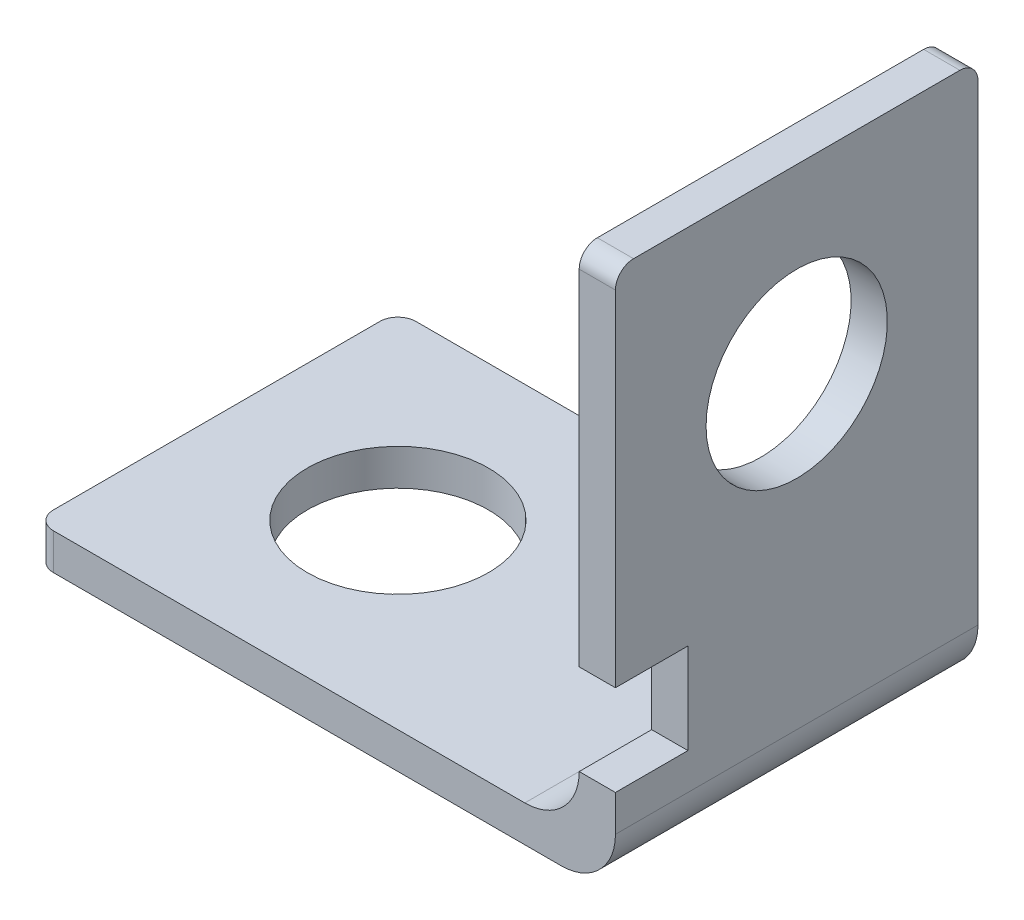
ISO-10303-21;
HEADER;
FILE_DESCRIPTION(('STEP AP214'),'2;1');
FILE_NAME('part.step','',(''),(''),'','','');
FILE_SCHEMA(('AUTOMOTIVE_DESIGN { 1 0 10303 214 1 1 1 1 }'));
ENDSEC;
DATA;
#1=APPLICATION_CONTEXT('core data for automotive mechanical design processes');
#2=APPLICATION_PROTOCOL_DEFINITION('international standard','automotive_design',2000,#1);
#3=PRODUCT_CONTEXT('',#1,'mechanical');
#4=PRODUCT('Part','Part','',(#3));
#5=PRODUCT_RELATED_PRODUCT_CATEGORY('part','',(#4));
#6=PRODUCT_DEFINITION_FORMATION('','',#4);
#7=PRODUCT_DEFINITION_CONTEXT('part definition',#1,'design');
#8=PRODUCT_DEFINITION('design','',#6,#7);
#9=PRODUCT_DEFINITION_SHAPE('','',#8);
#10=(LENGTH_UNIT() NAMED_UNIT(*) SI_UNIT(.MILLI.,.METRE.));
#11=(NAMED_UNIT(*) PLANE_ANGLE_UNIT() SI_UNIT($,.RADIAN.));
#12=(NAMED_UNIT(*) SI_UNIT($,.STERADIAN.) SOLID_ANGLE_UNIT());
#13=UNCERTAINTY_MEASURE_WITH_UNIT(LENGTH_MEASURE(1.E-05),#10,'distance_accuracy_value','');
#14=(GEOMETRIC_REPRESENTATION_CONTEXT(3) GLOBAL_UNCERTAINTY_ASSIGNED_CONTEXT((#13)) GLOBAL_UNIT_ASSIGNED_CONTEXT((#10,
#11,#12)) REPRESENTATION_CONTEXT('',''));
#15=CARTESIAN_POINT('',(0.,0.,0.));
#16=DIRECTION('',(0.,0.,1.));
#17=DIRECTION('',(1.,0.,0.));
#18=AXIS2_PLACEMENT_3D('',#15,#16,#17);
#19=CARTESIAN_POINT('',(0.,2.,20.));
#20=DIRECTION('',(0.,0.,-1.));
#21=DIRECTION('',(-1.,0.,0.));
#22=AXIS2_PLACEMENT_3D('',#19,#20,#21);
#23=PLANE('',#22);
#24=DIRECTION('',(0.,-1.,0.));
#25=VECTOR('',#24,1.);
#26=CARTESIAN_POINT('',(32.,2.,20.));
#27=LINE('',#26,#25);
#28=CARTESIAN_POINT('',(32.,5.,20.));
#29=VERTEX_POINT('',#28);
#30=CARTESIAN_POINT('',(32.,3.,20.));
#31=VERTEX_POINT('',#30);
#32=EDGE_CURVE('E245',#29,#31,#27,.T.);
#33=ORIENTED_EDGE('',*,*,#32,.F.);
#34=DIRECTION('',(-1.,0.,0.));
#35=VECTOR('',#34,1.);
#36=CARTESIAN_POINT('',(60.,5.,20.));
#37=LINE('',#36,#35);
#38=CARTESIAN_POINT('',(30.,5.,20.));
#39=VERTEX_POINT('',#38);
#40=EDGE_CURVE('E186',#29,#39,#37,.T.);
#41=ORIENTED_EDGE('',*,*,#40,.T.);
#42=CARTESIAN_POINT('',(27.,5.,20.));
#43=DIRECTION('',(0.,0.,-1.));
#44=DIRECTION('',(-1.,0.,0.));
#45=AXIS2_PLACEMENT_3D('',#42,#43,#44);
#46=CIRCLE('',#45,3.);
#47=CARTESIAN_POINT('',(27.,2.,20.));
#48=VERTEX_POINT('',#47);
#49=EDGE_CURVE('E300',#39,#48,#46,.T.);
#50=ORIENTED_EDGE('',*,*,#49,.T.);
#51=DIRECTION('',(1.,0.,0.));
#52=VECTOR('',#51,1.);
#53=CARTESIAN_POINT('',(0.,2.,20.));
#54=LINE('',#53,#52);
#55=CARTESIAN_POINT('',(1.,2.,20.));
#56=VERTEX_POINT('',#55);
#57=EDGE_CURVE('E224',#56,#48,#54,.T.);
#58=ORIENTED_EDGE('',*,*,#57,.F.);
#59=DIRECTION('',(0.,-1.,0.));
#60=VECTOR('',#59,1.);
#61=CARTESIAN_POINT('',(1.,2.,20.));
#62=LINE('',#61,#60);
#63=CARTESIAN_POINT('',(1.,0.,20.));
#64=VERTEX_POINT('',#63);
#65=EDGE_CURVE('E249',#56,#64,#62,.T.);
#66=ORIENTED_EDGE('',*,*,#65,.T.);
#67=DIRECTION('',(1.,0.,0.));
#68=VECTOR('',#67,1.);
#69=CARTESIAN_POINT('',(0.,0.,20.));
#70=LINE('',#69,#68);
#71=CARTESIAN_POINT('',(29.,0.,20.));
#72=VERTEX_POINT('',#71);
#73=EDGE_CURVE('E237',#64,#72,#70,.T.);
#74=ORIENTED_EDGE('',*,*,#73,.T.);
#75=CARTESIAN_POINT('',(29.,3.,20.));
#76=DIRECTION('',(0.,0.,-1.));
#77=DIRECTION('',(-1.,0.,0.));
#78=AXIS2_PLACEMENT_3D('',#75,#76,#77);
#79=CIRCLE('',#78,3.);
#80=EDGE_CURVE('E290',#72,#31,#79,.F.);
#81=ORIENTED_EDGE('',*,*,#80,.T.);
#82=EDGE_LOOP('',(#33,#41,#50,#58,#66,#74,#81));
#83=FACE_BOUND('',#82,.T.);
#84=ADVANCED_FACE('F38',(#83),#23,.F.);
#85=CARTESIAN_POINT('',(0.,2.,0.));
#86=DIRECTION('',(1.,0.,0.));
#87=DIRECTION('',(0.,0.,-1.));
#88=AXIS2_PLACEMENT_3D('',#85,#86,#87);
#89=PLANE('',#88);
#90=DIRECTION('',(0.,0.,1.));
#91=VECTOR('',#90,1.);
#92=CARTESIAN_POINT('',(0.,0.,0.));
#93=LINE('',#92,#91);
#94=CARTESIAN_POINT('',(0.,0.,1.));
#95=VERTEX_POINT('',#94);
#96=CARTESIAN_POINT('',(0.,0.,19.));
#97=VERTEX_POINT('',#96);
#98=EDGE_CURVE('E233',#95,#97,#93,.T.);
#99=ORIENTED_EDGE('',*,*,#98,.T.);
#100=DIRECTION('',(0.,-1.,0.));
#101=VECTOR('',#100,1.);
#102=CARTESIAN_POINT('',(0.,2.,19.));
#103=LINE('',#102,#101);
#104=CARTESIAN_POINT('',(0.,2.,19.));
#105=VERTEX_POINT('',#104);
#106=EDGE_CURVE('E267',#97,#105,#103,.F.);
#107=ORIENTED_EDGE('',*,*,#106,.T.);
#108=DIRECTION('',(0.,0.,1.));
#109=VECTOR('',#108,1.);
#110=CARTESIAN_POINT('',(0.,2.,0.));
#111=LINE('',#110,#109);
#112=CARTESIAN_POINT('',(0.,2.,1.));
#113=VERTEX_POINT('',#112);
#114=EDGE_CURVE('E220',#113,#105,#111,.T.);
#115=ORIENTED_EDGE('',*,*,#114,.F.);
#116=DIRECTION('',(0.,-1.,0.));
#117=VECTOR('',#116,1.);
#118=CARTESIAN_POINT('',(0.,2.,1.));
#119=LINE('',#118,#117);
#120=EDGE_CURVE('E263',#113,#95,#119,.T.);
#121=ORIENTED_EDGE('',*,*,#120,.T.);
#122=EDGE_LOOP('',(#99,#107,#115,#121));
#123=FACE_BOUND('',#122,.T.);
#124=ADVANCED_FACE('F376',(#123),#89,.F.);
#125=CARTESIAN_POINT('',(32.,29.,20.));
#126=VERTEX_POINT('',#125);
#127=CARTESIAN_POINT('',(32.,10.,20.));
#128=VERTEX_POINT('',#127);
#129=EDGE_CURVE('E246',#126,#128,#27,.T.);
#130=ORIENTED_EDGE('',*,*,#129,.F.);
#131=DIRECTION('',(1.,0.,0.));
#132=VECTOR('',#131,1.);
#133=CARTESIAN_POINT('',(0.,29.,20.));
#134=LINE('',#133,#132);
#135=CARTESIAN_POINT('',(30.,29.,20.));
#136=VERTEX_POINT('',#135);
#137=EDGE_CURVE('E62',#126,#136,#134,.F.);
#138=ORIENTED_EDGE('',*,*,#137,.T.);
#139=DIRECTION('',(0.,-1.,0.));
#140=VECTOR('',#139,1.);
#141=CARTESIAN_POINT('',(30.,30.,20.));
#142=LINE('',#141,#140);
#143=CARTESIAN_POINT('',(30.,10.,20.));
#144=VERTEX_POINT('',#143);
#145=EDGE_CURVE('E147',#136,#144,#142,.T.);
#146=ORIENTED_EDGE('',*,*,#145,.T.);
#147=DIRECTION('',(-1.,0.,0.));
#148=VECTOR('',#147,1.);
#149=CARTESIAN_POINT('',(60.,10.,20.));
#150=LINE('',#149,#148);
#151=EDGE_CURVE('E150',#128,#144,#150,.T.);
#152=ORIENTED_EDGE('',*,*,#151,.F.);
#153=EDGE_LOOP('',(#130,#138,#146,#152));
#154=FACE_BOUND('',#153,.T.);
#155=ADVANCED_FACE('F149',(#154),#23,.F.);
#156=CARTESIAN_POINT('',(32.,2.,0.));
#157=DIRECTION('',(-1.,0.,0.));
#158=DIRECTION('',(0.,0.,1.));
#159=AXIS2_PLACEMENT_3D('',#156,#157,#158);
#160=PLANE('',#159);
#161=CARTESIAN_POINT('',(32.,20.,10.));
#162=DIRECTION('',(-1.,0.,0.));
#163=DIRECTION('',(0.,0.,1.));
#164=AXIS2_PLACEMENT_3D('',#161,#162,#163);
#165=CIRCLE('',#164,5.);
#166=CARTESIAN_POINT('',(32.,20.,15.));
#167=VERTEX_POINT('',#166);
#168=EDGE_CURVE('E174',#167,#167,#165,.T.);
#169=ORIENTED_EDGE('',*,*,#168,.T.);
#170=EDGE_LOOP('',(#169));
#171=FACE_BOUND('',#170,.T.);
#172=DIRECTION('',(0.,0.,-1.));
#173=VECTOR('',#172,1.);
#174=CARTESIAN_POINT('',(32.,30.,0.));
#175=LINE('',#174,#173);
#176=CARTESIAN_POINT('',(32.,30.,19.));
#177=VERTEX_POINT('',#176);
#178=CARTESIAN_POINT('',(32.,30.,1.));
#179=VERTEX_POINT('',#178);
#180=EDGE_CURVE('E206',#177,#179,#175,.T.);
#181=ORIENTED_EDGE('',*,*,#180,.F.);
#182=CARTESIAN_POINT('',(32.,29.,19.));
#183=DIRECTION('',(-1.,0.,0.));
#184=DIRECTION('',(0.,0.,1.));
#185=AXIS2_PLACEMENT_3D('',#182,#183,#184);
#186=CIRCLE('',#185,1.);
#187=EDGE_CURVE('E318',#177,#126,#186,.F.);
#188=ORIENTED_EDGE('',*,*,#187,.T.);
#189=ORIENTED_EDGE('',*,*,#129,.T.);
#190=DIRECTION('',(0.,0.,-1.));
#191=VECTOR('',#190,1.);
#192=CARTESIAN_POINT('',(32.,10.,0.));
#193=LINE('',#192,#191);
#194=CARTESIAN_POINT('',(32.,10.,16.));
#195=VERTEX_POINT('',#194);
#196=EDGE_CURVE('E165',#128,#195,#193,.T.);
#197=ORIENTED_EDGE('',*,*,#196,.T.);
#198=DIRECTION('',(0.,-1.,0.));
#199=VECTOR('',#198,1.);
#200=CARTESIAN_POINT('',(32.,2.,16.));
#201=LINE('',#200,#199);
#202=CARTESIAN_POINT('',(32.,5.,16.));
#203=VERTEX_POINT('',#202);
#204=EDGE_CURVE('E202',#195,#203,#201,.T.);
#205=ORIENTED_EDGE('',*,*,#204,.T.);
#206=DIRECTION('',(0.,0.,1.));
#207=VECTOR('',#206,1.);
#208=CARTESIAN_POINT('',(32.,5.,0.));
#209=LINE('',#208,#207);
#210=EDGE_CURVE('E190',#203,#29,#209,.T.);
#211=ORIENTED_EDGE('',*,*,#210,.T.);
#212=ORIENTED_EDGE('',*,*,#32,.T.);
#213=DIRECTION('',(0.,0.,-1.));
#214=VECTOR('',#213,1.);
#215=CARTESIAN_POINT('',(32.,3.,0.));
#216=LINE('',#215,#214);
#217=CARTESIAN_POINT('',(32.,3.,0.));
#218=VERTEX_POINT('',#217);
#219=EDGE_CURVE('E280',#31,#218,#216,.T.);
#220=ORIENTED_EDGE('',*,*,#219,.T.);
#221=DIRECTION('',(0.,-1.,0.));
#222=VECTOR('',#221,1.);
#223=CARTESIAN_POINT('',(32.,2.,0.));
#224=LINE('',#223,#222);
#225=CARTESIAN_POINT('',(32.,29.,0.));
#226=VERTEX_POINT('',#225);
#227=EDGE_CURVE('E232',#226,#218,#224,.T.);
#228=ORIENTED_EDGE('',*,*,#227,.F.);
#229=CARTESIAN_POINT('',(32.,29.,1.));
#230=DIRECTION('',(-1.,0.,0.));
#231=DIRECTION('',(0.,0.,1.));
#232=AXIS2_PLACEMENT_3D('',#229,#230,#231);
#233=CIRCLE('',#232,1.);
#234=EDGE_CURVE('E315',#226,#179,#233,.F.);
#235=ORIENTED_EDGE('',*,*,#234,.T.);
#236=EDGE_LOOP('',(#181,#188,#189,#197,#205,#211,#212,#220,#228,#235));
#237=FACE_BOUND('',#236,.T.);
#238=ADVANCED_FACE('F333',(#171,#237),#160,.F.);
#239=CARTESIAN_POINT('',(0.,2.,0.));
#240=DIRECTION('',(0.,0.,1.));
#241=DIRECTION('',(1.,0.,0.));
#242=AXIS2_PLACEMENT_3D('',#239,#240,#241);
#243=PLANE('',#242);
#244=DIRECTION('',(0.,-1.,0.));
#245=VECTOR('',#244,1.);
#246=CARTESIAN_POINT('',(30.,30.,0.));
#247=LINE('',#246,#245);
#248=CARTESIAN_POINT('',(30.,29.,0.));
#249=VERTEX_POINT('',#248);
#250=CARTESIAN_POINT('',(30.,5.,0.));
#251=VERTEX_POINT('',#250);
#252=EDGE_CURVE('E154',#249,#251,#247,.T.);
#253=ORIENTED_EDGE('',*,*,#252,.F.);
#254=DIRECTION('',(-1.,0.,0.));
#255=VECTOR('',#254,1.);
#256=CARTESIAN_POINT('',(0.,29.,0.));
#257=LINE('',#256,#255);
#258=EDGE_CURVE('E11',#249,#226,#257,.F.);
#259=ORIENTED_EDGE('',*,*,#258,.T.);
#260=ORIENTED_EDGE('',*,*,#227,.T.);
#261=CARTESIAN_POINT('',(29.,3.,0.));
#262=DIRECTION('',(0.,0.,1.));
#263=DIRECTION('',(1.,0.,0.));
#264=AXIS2_PLACEMENT_3D('',#261,#262,#263);
#265=CIRCLE('',#264,3.);
#266=CARTESIAN_POINT('',(29.,0.,0.));
#267=VERTEX_POINT('',#266);
#268=EDGE_CURVE('E284',#218,#267,#265,.F.);
#269=ORIENTED_EDGE('',*,*,#268,.T.);
#270=DIRECTION('',(-1.,0.,0.));
#271=VECTOR('',#270,1.);
#272=CARTESIAN_POINT('',(0.,0.,0.));
#273=LINE('',#272,#271);
#274=CARTESIAN_POINT('',(1.,0.,0.));
#275=VERTEX_POINT('',#274);
#276=EDGE_CURVE('E225',#267,#275,#273,.T.);
#277=ORIENTED_EDGE('',*,*,#276,.T.);
#278=DIRECTION('',(0.,-1.,0.));
#279=VECTOR('',#278,1.);
#280=CARTESIAN_POINT('',(1.,2.,0.));
#281=LINE('',#280,#279);
#282=CARTESIAN_POINT('',(1.,2.,0.));
#283=VERTEX_POINT('',#282);
#284=EDGE_CURVE('E276',#275,#283,#281,.F.);
#285=ORIENTED_EDGE('',*,*,#284,.T.);
#286=DIRECTION('',(-1.,0.,0.));
#287=VECTOR('',#286,1.);
#288=CARTESIAN_POINT('',(0.,2.,0.));
#289=LINE('',#288,#287);
#290=CARTESIAN_POINT('',(27.,2.,0.));
#291=VERTEX_POINT('',#290);
#292=EDGE_CURVE('E229',#291,#283,#289,.T.);
#293=ORIENTED_EDGE('',*,*,#292,.F.);
#294=CARTESIAN_POINT('',(27.,5.,0.));
#295=DIRECTION('',(0.,0.,1.));
#296=DIRECTION('',(1.,0.,0.));
#297=AXIS2_PLACEMENT_3D('',#294,#295,#296);
#298=CIRCLE('',#297,3.);
#299=EDGE_CURVE('E303',#291,#251,#298,.T.);
#300=ORIENTED_EDGE('',*,*,#299,.T.);
#301=EDGE_LOOP('',(#253,#259,#260,#269,#277,#285,#293,#300));
#302=FACE_BOUND('',#301,.T.);
#303=ADVANCED_FACE('F339',(#302),#243,.F.);
#304=CARTESIAN_POINT('',(0.,2.,0.));
#305=DIRECTION('',(0.,1.,0.));
#306=DIRECTION('',(0.,0.,1.));
#307=AXIS2_PLACEMENT_3D('',#304,#305,#306);
#308=PLANE('',#307);
#309=ORIENTED_EDGE('',*,*,#57,.T.);
#310=DIRECTION('',(0.,0.,1.));
#311=VECTOR('',#310,1.);
#312=CARTESIAN_POINT('',(27.,2.,0.));
#313=LINE('',#312,#311);
#314=EDGE_CURVE('E297',#48,#291,#313,.F.);
#315=ORIENTED_EDGE('',*,*,#314,.T.);
#316=ORIENTED_EDGE('',*,*,#292,.T.);
#317=CARTESIAN_POINT('',(1.,2.,1.));
#318=DIRECTION('',(0.,1.,0.));
#319=DIRECTION('',(0.,0.,1.));
#320=AXIS2_PLACEMENT_3D('',#317,#318,#319);
#321=CIRCLE('',#320,1.);
#322=EDGE_CURVE('E270',#283,#113,#321,.T.);
#323=ORIENTED_EDGE('',*,*,#322,.T.);
#324=ORIENTED_EDGE('',*,*,#114,.T.);
#325=CARTESIAN_POINT('',(1.,2.,19.));
#326=DIRECTION('',(0.,1.,0.));
#327=DIRECTION('',(0.,0.,1.));
#328=AXIS2_PLACEMENT_3D('',#325,#326,#327);
#329=CIRCLE('',#328,1.);
#330=EDGE_CURVE('E273',#105,#56,#329,.T.);
#331=ORIENTED_EDGE('',*,*,#330,.T.);
#332=EDGE_LOOP('',(#309,#315,#316,#323,#324,#331));
#333=FACE_BOUND('',#332,.T.);
#334=CARTESIAN_POINT('',(10.,2.,10.));
#335=DIRECTION('',(0.,1.,0.));
#336=DIRECTION('',(0.,0.,1.));
#337=AXIS2_PLACEMENT_3D('',#334,#335,#336);
#338=CIRCLE('',#337,5.);
#339=CARTESIAN_POINT('',(10.,2.,15.));
#340=VERTEX_POINT('',#339);
#341=EDGE_CURVE('E215',#340,#340,#338,.T.);
#342=ORIENTED_EDGE('',*,*,#341,.F.);
#343=EDGE_LOOP('',(#342));
#344=FACE_BOUND('',#343,.T.);
#345=ADVANCED_FACE('F380',(#333,#344),#308,.T.);
#346=CARTESIAN_POINT('',(0.,0.,0.));
#347=DIRECTION('',(0.,1.,0.));
#348=DIRECTION('',(0.,0.,1.));
#349=AXIS2_PLACEMENT_3D('',#346,#347,#348);
#350=PLANE('',#349);
#351=CARTESIAN_POINT('',(10.,0.,10.));
#352=DIRECTION('',(0.,1.,0.));
#353=DIRECTION('',(0.,0.,1.));
#354=AXIS2_PLACEMENT_3D('',#351,#352,#353);
#355=CIRCLE('',#354,5.);
#356=CARTESIAN_POINT('',(10.,0.,15.));
#357=VERTEX_POINT('',#356);
#358=EDGE_CURVE('E219',#357,#357,#355,.T.);
#359=ORIENTED_EDGE('',*,*,#358,.T.);
#360=EDGE_LOOP('',(#359));
#361=FACE_BOUND('',#360,.T.);
#362=ORIENTED_EDGE('',*,*,#276,.F.);
#363=DIRECTION('',(0.,0.,-1.));
#364=VECTOR('',#363,1.);
#365=CARTESIAN_POINT('',(29.,0.,0.));
#366=LINE('',#365,#364);
#367=EDGE_CURVE('E287',#267,#72,#366,.F.);
#368=ORIENTED_EDGE('',*,*,#367,.T.);
#369=ORIENTED_EDGE('',*,*,#73,.F.);
#370=CARTESIAN_POINT('',(1.,0.,19.));
#371=DIRECTION('',(0.,1.,0.));
#372=DIRECTION('',(0.,0.,1.));
#373=AXIS2_PLACEMENT_3D('',#370,#371,#372);
#374=CIRCLE('',#373,1.);
#375=EDGE_CURVE('E260',#64,#97,#374,.F.);
#376=ORIENTED_EDGE('',*,*,#375,.T.);
#377=ORIENTED_EDGE('',*,*,#98,.F.);
#378=CARTESIAN_POINT('',(1.,0.,1.));
#379=DIRECTION('',(0.,1.,0.));
#380=DIRECTION('',(0.,0.,1.));
#381=AXIS2_PLACEMENT_3D('',#378,#379,#380);
#382=CIRCLE('',#381,1.);
#383=EDGE_CURVE('E256',#95,#275,#382,.F.);
#384=ORIENTED_EDGE('',*,*,#383,.T.);
#385=EDGE_LOOP('',(#362,#368,#369,#376,#377,#384));
#386=FACE_BOUND('',#385,.T.);
#387=ADVANCED_FACE('F349',(#361,#386),#350,.F.);
#388=CARTESIAN_POINT('',(10.,-11.,10.));
#389=DIRECTION('',(0.,1.,0.));
#390=DIRECTION('',(0.,0.,1.));
#391=AXIS2_PLACEMENT_3D('',#388,#389,#390);
#392=CYLINDRICAL_SURFACE('',#391,5.);
#393=CARTESIAN_POINT('',(10.,2.,15.));
#394=CARTESIAN_POINT('',(10.,1.97916666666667,15.));
#395=CARTESIAN_POINT('',(10.,1.95833333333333,15.));
#396=CARTESIAN_POINT('',(10.,1.91666666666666,15.));
#397=CARTESIAN_POINT('',(10.,1.89583333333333,15.));
#398=CARTESIAN_POINT('',(10.,1.85416666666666,15.));
#399=CARTESIAN_POINT('',(10.,1.83333333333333,15.));
#400=CARTESIAN_POINT('',(10.,1.79166666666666,15.));
#401=CARTESIAN_POINT('',(10.,1.77083333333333,15.));
#402=CARTESIAN_POINT('',(10.,1.72916666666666,15.));
#403=CARTESIAN_POINT('',(10.,1.70833333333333,15.));
#404=CARTESIAN_POINT('',(10.,1.66666666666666,15.));
#405=CARTESIAN_POINT('',(10.,1.64583333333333,15.));
#406=CARTESIAN_POINT('',(10.,1.60416666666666,15.));
#407=CARTESIAN_POINT('',(10.,1.58333333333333,15.));
#408=CARTESIAN_POINT('',(10.,1.54166666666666,15.));
#409=CARTESIAN_POINT('',(10.,1.52083333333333,15.));
#410=CARTESIAN_POINT('',(10.,1.47916666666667,15.));
#411=CARTESIAN_POINT('',(10.,1.45833333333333,15.));
#412=CARTESIAN_POINT('',(10.,1.41666666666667,15.));
#413=CARTESIAN_POINT('',(10.,1.39583333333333,15.));
#414=CARTESIAN_POINT('',(10.,1.35416666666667,15.));
#415=CARTESIAN_POINT('',(10.,1.33333333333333,15.));
#416=CARTESIAN_POINT('',(10.,1.29166666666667,15.));
#417=CARTESIAN_POINT('',(10.,1.27083333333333,15.));
#418=CARTESIAN_POINT('',(10.,1.22916666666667,15.));
#419=CARTESIAN_POINT('',(10.,1.20833333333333,15.));
#420=CARTESIAN_POINT('',(10.,1.16666666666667,15.));
#421=CARTESIAN_POINT('',(10.,1.14583333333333,15.));
#422=CARTESIAN_POINT('',(10.,1.10416666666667,15.));
#423=CARTESIAN_POINT('',(10.,1.08333333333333,15.));
#424=CARTESIAN_POINT('',(10.,1.04166666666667,15.));
#425=CARTESIAN_POINT('',(10.,1.02083333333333,15.));
#426=CARTESIAN_POINT('',(10.,0.979166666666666,15.));
#427=CARTESIAN_POINT('',(10.,0.958333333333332,15.));
#428=CARTESIAN_POINT('',(10.,0.916666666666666,15.));
#429=CARTESIAN_POINT('',(10.,0.895833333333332,15.));
#430=CARTESIAN_POINT('',(10.,0.854166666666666,15.));
#431=CARTESIAN_POINT('',(10.,0.833333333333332,15.));
#432=CARTESIAN_POINT('',(10.,0.791666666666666,15.));
#433=CARTESIAN_POINT('',(10.,0.770833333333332,15.));
#434=CARTESIAN_POINT('',(10.,0.729166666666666,15.));
#435=CARTESIAN_POINT('',(10.,0.708333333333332,15.));
#436=CARTESIAN_POINT('',(10.,0.666666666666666,15.));
#437=CARTESIAN_POINT('',(10.,0.645833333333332,15.));
#438=CARTESIAN_POINT('',(10.,0.604166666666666,15.));
#439=CARTESIAN_POINT('',(10.,0.583333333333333,15.));
#440=CARTESIAN_POINT('',(10.,0.541666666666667,15.));
#441=CARTESIAN_POINT('',(10.,0.520833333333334,15.));
#442=CARTESIAN_POINT('',(10.,0.479166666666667,15.));
#443=CARTESIAN_POINT('',(10.,0.458333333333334,15.));
#444=CARTESIAN_POINT('',(10.,0.416666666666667,15.));
#445=CARTESIAN_POINT('',(10.,0.395833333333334,15.));
#446=CARTESIAN_POINT('',(10.,0.354166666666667,15.));
#447=CARTESIAN_POINT('',(10.,0.333333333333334,15.));
#448=CARTESIAN_POINT('',(10.,0.291666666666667,15.));
#449=CARTESIAN_POINT('',(10.,0.270833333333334,15.));
#450=CARTESIAN_POINT('',(10.,0.229166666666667,15.));
#451=CARTESIAN_POINT('',(10.,0.208333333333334,15.));
#452=CARTESIAN_POINT('',(10.,0.166666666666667,15.));
#453=CARTESIAN_POINT('',(10.,0.145833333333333,15.));
#454=CARTESIAN_POINT('',(10.,0.104166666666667,15.));
#455=CARTESIAN_POINT('',(10.,0.0833333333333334,15.));
#456=CARTESIAN_POINT('',(10.,0.0416666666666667,15.));
#457=CARTESIAN_POINT('',(10.,0.0208333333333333,15.));
#458=CARTESIAN_POINT('',(10.,0.,15.));
#459=B_SPLINE_CURVE_WITH_KNOTS('',3,(#393,#394,#395,#396,#397,#398,#399,#400,#401,#402,#403,
#404,#405,#406,#407,#408,#409,#410,#411,#412,#413,#414,#415,#416,#417,#418,#419,#420,#421,#422,
#423,#424,#425,#426,#427,#428,#429,#430,#431,#432,#433,#434,#435,#436,#437,#438,#439,#440,#441,
#442,#443,#444,#445,#446,#447,#448,#449,#450,#451,#452,#453,#454,#455,#456,#457,#458),
.UNSPECIFIED.,.F.,.F.,(4,2,2,2,2,2,2,2,2,2,2,2,2,2,2,2,2,2,2,2,2,2,2,2,2,2,2,2,2,2,2,2,4),(0.,
0.0625000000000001,0.125,0.1875,0.25,0.3125,0.375,0.4375,0.5,0.562499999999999,
0.624999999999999,0.687499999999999,0.749999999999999,0.812499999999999,0.874999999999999,
0.937499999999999,0.999999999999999,1.0625,1.125,1.1875,1.25,1.3125,1.375,1.4375,1.5,1.5625,
1.625,1.6875,1.75,1.8125,1.875,1.9375,2.),.UNSPECIFIED.);
#460=EDGE_CURVE('BSEAM386',#340,#357,#459,.T.);
#461=ORIENTED_EDGE('',*,*,#341,.T.);
#462=ORIENTED_EDGE('',*,*,#358,.F.);
#463=ORIENTED_EDGE('',*,*,#460,.T.);
#464=ORIENTED_EDGE('',*,*,#460,.F.);
#465=EDGE_LOOP('',(#461,#463,#462,#464));
#466=FACE_BOUND('',#465,.T.);
#467=ADVANCED_FACE('F386',(#466),#392,.F.);
#468=CARTESIAN_POINT('',(1.,2.,19.));
#469=DIRECTION('',(0.,-1.,0.));
#470=DIRECTION('',(0.,0.,-1.));
#471=AXIS2_PLACEMENT_3D('',#468,#469,#470);
#472=CYLINDRICAL_SURFACE('',#471,1.);
#473=ORIENTED_EDGE('',*,*,#330,.F.);
#474=ORIENTED_EDGE('',*,*,#106,.F.);
#475=ORIENTED_EDGE('',*,*,#375,.F.);
#476=ORIENTED_EDGE('',*,*,#65,.F.);
#477=EDGE_LOOP('',(#473,#474,#475,#476));
#478=FACE_BOUND('',#477,.T.);
#479=ADVANCED_FACE('F379',(#478),#472,.T.);
#480=CARTESIAN_POINT('',(1.,2.,1.));
#481=DIRECTION('',(0.,-1.,0.));
#482=DIRECTION('',(0.,0.,-1.));
#483=AXIS2_PLACEMENT_3D('',#480,#481,#482);
#484=CYLINDRICAL_SURFACE('',#483,1.);
#485=ORIENTED_EDGE('',*,*,#322,.F.);
#486=ORIENTED_EDGE('',*,*,#284,.F.);
#487=ORIENTED_EDGE('',*,*,#383,.F.);
#488=ORIENTED_EDGE('',*,*,#120,.F.);
#489=EDGE_LOOP('',(#485,#486,#487,#488));
#490=FACE_BOUND('',#489,.T.);
#491=ADVANCED_FACE('F356',(#490),#484,.T.);
#492=CARTESIAN_POINT('',(30.,30.,0.));
#493=DIRECTION('',(1.,0.,0.));
#494=DIRECTION('',(0.,0.,-1.));
#495=AXIS2_PLACEMENT_3D('',#492,#493,#494);
#496=PLANE('',#495);
#497=CARTESIAN_POINT('',(30.,20.,10.));
#498=DIRECTION('',(-1.,0.,0.));
#499=DIRECTION('',(0.,0.,1.));
#500=AXIS2_PLACEMENT_3D('',#497,#498,#499);
#501=CIRCLE('',#500,5.);
#502=CARTESIAN_POINT('',(30.,20.,15.));
#503=VERTEX_POINT('',#502);
#504=EDGE_CURVE('E180',#503,#503,#501,.T.);
#505=ORIENTED_EDGE('',*,*,#504,.F.);
#506=EDGE_LOOP('',(#505));
#507=FACE_BOUND('',#506,.T.);
#508=ORIENTED_EDGE('',*,*,#145,.F.);
#509=CARTESIAN_POINT('',(30.,29.,19.));
#510=DIRECTION('',(1.,0.,0.));
#511=DIRECTION('',(0.,0.,-1.));
#512=AXIS2_PLACEMENT_3D('',#509,#510,#511);
#513=CIRCLE('',#512,1.);
#514=CARTESIAN_POINT('',(30.,30.,19.));
#515=VERTEX_POINT('',#514);
#516=EDGE_CURVE('E47',#136,#515,#513,.F.);
#517=ORIENTED_EDGE('',*,*,#516,.T.);
#518=DIRECTION('',(0.,0.,1.));
#519=VECTOR('',#518,1.);
#520=CARTESIAN_POINT('',(30.,30.,0.));
#521=LINE('',#520,#519);
#522=CARTESIAN_POINT('',(30.,30.,1.));
#523=VERTEX_POINT('',#522);
#524=EDGE_CURVE('E155',#523,#515,#521,.T.);
#525=ORIENTED_EDGE('',*,*,#524,.F.);
#526=CARTESIAN_POINT('',(30.,29.,1.));
#527=DIRECTION('',(1.,0.,0.));
#528=DIRECTION('',(0.,0.,-1.));
#529=AXIS2_PLACEMENT_3D('',#526,#527,#528);
#530=CIRCLE('',#529,1.);
#531=EDGE_CURVE('E54',#523,#249,#530,.F.);
#532=ORIENTED_EDGE('',*,*,#531,.T.);
#533=ORIENTED_EDGE('',*,*,#252,.T.);
#534=DIRECTION('',(0.,0.,1.));
#535=VECTOR('',#534,1.);
#536=CARTESIAN_POINT('',(30.,5.,0.));
#537=LINE('',#536,#535);
#538=CARTESIAN_POINT('',(30.,5.,16.));
#539=VERTEX_POINT('',#538);
#540=EDGE_CURVE('E294',#251,#539,#537,.T.);
#541=ORIENTED_EDGE('',*,*,#540,.T.);
#542=DIRECTION('',(0.,-1.,0.));
#543=VECTOR('',#542,1.);
#544=CARTESIAN_POINT('',(30.,5.,16.));
#545=LINE('',#544,#543);
#546=CARTESIAN_POINT('',(30.,10.,16.));
#547=VERTEX_POINT('',#546);
#548=EDGE_CURVE('E172',#547,#539,#545,.T.);
#549=ORIENTED_EDGE('',*,*,#548,.F.);
#550=DIRECTION('',(0.,0.,-1.));
#551=VECTOR('',#550,1.);
#552=CARTESIAN_POINT('',(30.,10.,20.));
#553=LINE('',#552,#551);
#554=EDGE_CURVE('E162',#144,#547,#553,.T.);
#555=ORIENTED_EDGE('',*,*,#554,.F.);
#556=EDGE_LOOP('',(#508,#517,#525,#532,#533,#541,#549,#555));
#557=FACE_BOUND('',#556,.T.);
#558=ADVANCED_FACE('F170',(#507,#557),#496,.F.);
#559=CARTESIAN_POINT('',(0.,30.,0.));
#560=DIRECTION('',(0.,-1.,0.));
#561=DIRECTION('',(0.,0.,-1.));
#562=AXIS2_PLACEMENT_3D('',#559,#560,#561);
#563=PLANE('',#562);
#564=ORIENTED_EDGE('',*,*,#524,.T.);
#565=DIRECTION('',(1.,0.,0.));
#566=VECTOR('',#565,1.);
#567=CARTESIAN_POINT('',(0.,30.,19.));
#568=LINE('',#567,#566);
#569=EDGE_CURVE('E311',#515,#177,#568,.T.);
#570=ORIENTED_EDGE('',*,*,#569,.T.);
#571=ORIENTED_EDGE('',*,*,#180,.T.);
#572=DIRECTION('',(-1.,0.,0.));
#573=VECTOR('',#572,1.);
#574=CARTESIAN_POINT('',(0.,30.,1.));
#575=LINE('',#574,#573);
#576=EDGE_CURVE('E307',#179,#523,#575,.T.);
#577=ORIENTED_EDGE('',*,*,#576,.T.);
#578=EDGE_LOOP('',(#564,#570,#571,#577));
#579=FACE_BOUND('',#578,.T.);
#580=ADVANCED_FACE('F328',(#579),#563,.F.);
#581=CARTESIAN_POINT('',(29.,3.,0.));
#582=DIRECTION('',(0.,0.,-1.));
#583=DIRECTION('',(-1.,0.,0.));
#584=AXIS2_PLACEMENT_3D('',#581,#582,#583);
#585=CYLINDRICAL_SURFACE('',#584,3.);
#586=ORIENTED_EDGE('',*,*,#80,.F.);
#587=ORIENTED_EDGE('',*,*,#367,.F.);
#588=ORIENTED_EDGE('',*,*,#268,.F.);
#589=ORIENTED_EDGE('',*,*,#219,.F.);
#590=EDGE_LOOP('',(#586,#587,#588,#589));
#591=FACE_BOUND('',#590,.T.);
#592=ADVANCED_FACE('F345',(#591),#585,.T.);
#593=CARTESIAN_POINT('',(27.,5.,0.));
#594=DIRECTION('',(0.,0.,1.));
#595=DIRECTION('',(1.,0.,0.));
#596=AXIS2_PLACEMENT_3D('',#593,#594,#595);
#597=CYLINDRICAL_SURFACE('',#596,3.);
#598=ORIENTED_EDGE('',*,*,#299,.F.);
#599=ORIENTED_EDGE('',*,*,#314,.F.);
#600=ORIENTED_EDGE('',*,*,#49,.F.);
#601=DIRECTION('',(0.,0.,1.));
#602=VECTOR('',#601,1.);
#603=CARTESIAN_POINT('',(30.,5.,20.));
#604=LINE('',#603,#602);
#605=EDGE_CURVE('E168',#539,#39,#604,.T.);
#606=ORIENTED_EDGE('',*,*,#605,.F.);
#607=ORIENTED_EDGE('',*,*,#540,.F.);
#608=EDGE_LOOP('',(#598,#599,#600,#606,#607));
#609=FACE_BOUND('',#608,.T.);
#610=ADVANCED_FACE('F363',(#609),#597,.F.);
#611=CARTESIAN_POINT('',(60.,5.,16.));
#612=DIRECTION('',(0.,0.,-1.));
#613=DIRECTION('',(-1.,0.,0.));
#614=AXIS2_PLACEMENT_3D('',#611,#612,#613);
#615=PLANE('',#614);
#616=DIRECTION('',(-1.,0.,0.));
#617=VECTOR('',#616,1.);
#618=CARTESIAN_POINT('',(60.,10.,16.));
#619=LINE('',#618,#617);
#620=EDGE_CURVE('E167',#195,#547,#619,.T.);
#621=ORIENTED_EDGE('',*,*,#620,.T.);
#622=ORIENTED_EDGE('',*,*,#548,.T.);
#623=DIRECTION('',(-1.,0.,0.));
#624=VECTOR('',#623,1.);
#625=CARTESIAN_POINT('',(60.,5.,16.));
#626=LINE('',#625,#624);
#627=EDGE_CURVE('E191',#203,#539,#626,.T.);
#628=ORIENTED_EDGE('',*,*,#627,.F.);
#629=ORIENTED_EDGE('',*,*,#204,.F.);
#630=EDGE_LOOP('',(#621,#622,#628,#629));
#631=FACE_BOUND('',#630,.T.);
#632=ADVANCED_FACE('F425',(#631),#615,.F.);
#633=CARTESIAN_POINT('',(60.,10.,20.));
#634=DIRECTION('',(0.,1.,0.));
#635=DIRECTION('',(0.,0.,1.));
#636=AXIS2_PLACEMENT_3D('',#633,#634,#635);
#637=PLANE('',#636);
#638=ORIENTED_EDGE('',*,*,#151,.T.);
#639=ORIENTED_EDGE('',*,*,#554,.T.);
#640=ORIENTED_EDGE('',*,*,#620,.F.);
#641=ORIENTED_EDGE('',*,*,#196,.F.);
#642=EDGE_LOOP('',(#638,#639,#640,#641));
#643=FACE_BOUND('',#642,.T.);
#644=ADVANCED_FACE('F160',(#643),#637,.F.);
#645=CARTESIAN_POINT('',(60.,5.,20.));
#646=DIRECTION('',(0.,-1.,0.));
#647=DIRECTION('',(0.,0.,-1.));
#648=AXIS2_PLACEMENT_3D('',#645,#646,#647);
#649=PLANE('',#648);
#650=ORIENTED_EDGE('',*,*,#627,.T.);
#651=ORIENTED_EDGE('',*,*,#605,.T.);
#652=ORIENTED_EDGE('',*,*,#40,.F.);
#653=ORIENTED_EDGE('',*,*,#210,.F.);
#654=EDGE_LOOP('',(#650,#651,#652,#653));
#655=FACE_BOUND('',#654,.T.);
#656=ADVANCED_FACE('F367',(#655),#649,.F.);
#657=CARTESIAN_POINT('',(0.,29.,19.));
#658=DIRECTION('',(1.,0.,0.));
#659=DIRECTION('',(0.,0.,-1.));
#660=AXIS2_PLACEMENT_3D('',#657,#658,#659);
#661=CYLINDRICAL_SURFACE('',#660,1.);
#662=ORIENTED_EDGE('',*,*,#516,.F.);
#663=ORIENTED_EDGE('',*,*,#137,.F.);
#664=ORIENTED_EDGE('',*,*,#187,.F.);
#665=ORIENTED_EDGE('',*,*,#569,.F.);
#666=EDGE_LOOP('',(#662,#663,#664,#665));
#667=FACE_BOUND('',#666,.T.);
#668=ADVANCED_FACE('F331',(#667),#661,.T.);
#669=CARTESIAN_POINT('',(0.,29.,1.));
#670=DIRECTION('',(-1.,0.,0.));
#671=DIRECTION('',(0.,0.,1.));
#672=AXIS2_PLACEMENT_3D('',#669,#670,#671);
#673=CYLINDRICAL_SURFACE('',#672,1.);
#674=ORIENTED_EDGE('',*,*,#234,.F.);
#675=ORIENTED_EDGE('',*,*,#258,.F.);
#676=ORIENTED_EDGE('',*,*,#531,.F.);
#677=ORIENTED_EDGE('',*,*,#576,.F.);
#678=EDGE_LOOP('',(#674,#675,#676,#677));
#679=FACE_BOUND('',#678,.T.);
#680=ADVANCED_FACE('F40',(#679),#673,.T.);
#681=CARTESIAN_POINT('',(60.,20.,10.));
#682=DIRECTION('',(-1.,0.,0.));
#683=DIRECTION('',(0.,0.,1.));
#684=AXIS2_PLACEMENT_3D('',#681,#682,#683);
#685=CYLINDRICAL_SURFACE('',#684,5.);
#686=ORIENTED_EDGE('',*,*,#504,.T.);
#687=EDGE_LOOP('',(#686));
#688=FACE_BOUND('',#687,.T.);
#689=ORIENTED_EDGE('',*,*,#168,.F.);
#690=EDGE_LOOP('',(#689));
#691=FACE_BOUND('',#690,.T.);
#692=ADVANCED_FACE('F414',(#688,#691),#685,.F.);
#693=CLOSED_SHELL('',(#84,#124,#155,#238,#303,#345,#387,#467,#479,#491,#558,#580,#592,#610,#632,
#644,#656,#668,#680,#692));
#694=MANIFOLD_SOLID_BREP('B2',#693);
#695=ADVANCED_BREP_SHAPE_REPRESENTATION('',(#18,#694),#14);
#696=SHAPE_DEFINITION_REPRESENTATION(#9,#695);
ENDSEC;
END-ISO-10303-21;
